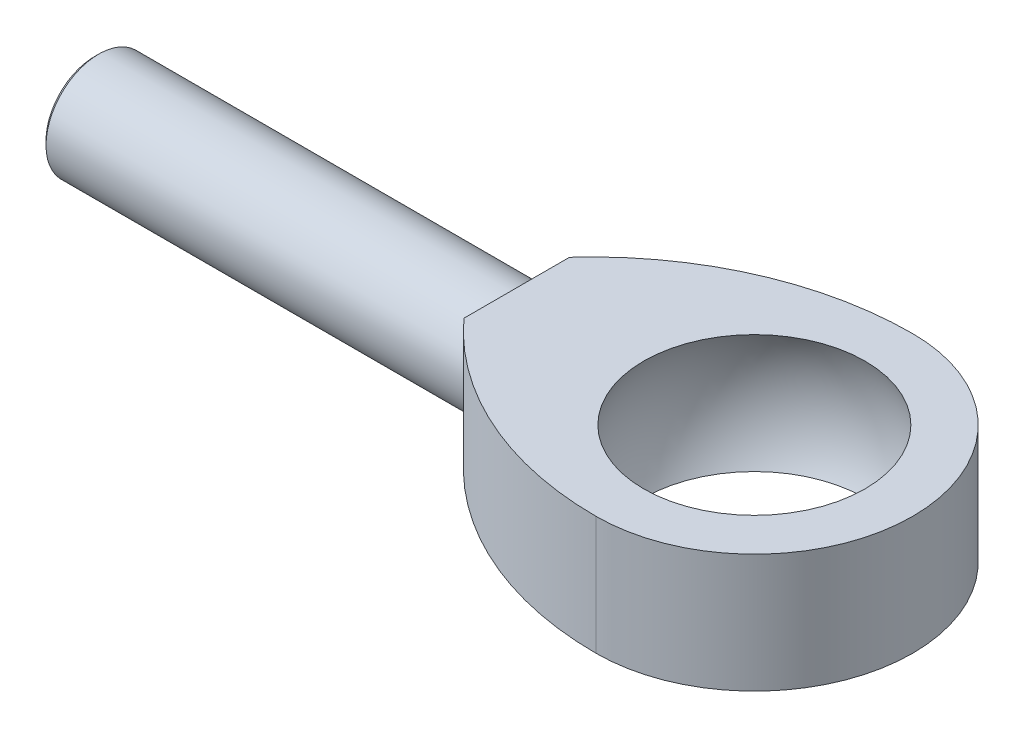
from build123d import *

# Parameters (mm, degrees)
EXTRUDE1_START = -7.1374
EXTRUDE1_DEPTH = 7.1374
SKETCH4_R      = 3.175
EXTRUDE2_DEPTH = 25.4
CHAMFER1_SIZE  = 0.254


with BuildPart() as part:
    # Sketch1 → Revolve1 (revolve)
    with BuildSketch(Plane.XY):
        with BuildLine():
            Line((-9.525, 3.5687), (-6.660711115, 3.5687))
            ThreePointArc((-6.660711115, 3.5687), (-7.5565, 0), (-6.660711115, -3.5687))
            Line((-6.660711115, -3.5687), (-9.525, -3.5687))
            Line((-9.525, -3.5687), (-9.525, 3.5687))
        make_face()
    revolve(axis=Axis((0, 32.890587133, 0), (0, -1, 0)))

    # Sketch3 → Extrude1 (add)
    with BuildSketch(Plane.XZ.offset(3.5687).offset(EXTRUDE1_START)):
        with BuildLine():
            Line((-14.3002, 3.175), (-14.3002, -3.175))
            ThreePointArc((-14.3002, -3.175), (-7.823334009, -7.866122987), (0, -9.525))
            ThreePointArc((0, -9.525), (-9.525, 0), (0, 9.525))
            ThreePointArc((0, 9.525), (-7.823334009, 7.866122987), (-14.3002, 3.175))
        make_face()
    extrude(amount=EXTRUDE1_DEPTH)

    # Sketch4 → Extrude2 (add)
    with BuildSketch(Plane.ZY.offset(14.3002)):
        Circle(SKETCH4_R)
    extrude(amount=EXTRUDE2_DEPTH)

    # Chamfer1
    chamfer1_edges = [part.edges().sort_by_distance(p)[0] for p in [
        (-39.7002, 0, -3.175),
    ]]
    chamfer(chamfer1_edges, length=CHAMFER1_SIZE)


solid = part.part
